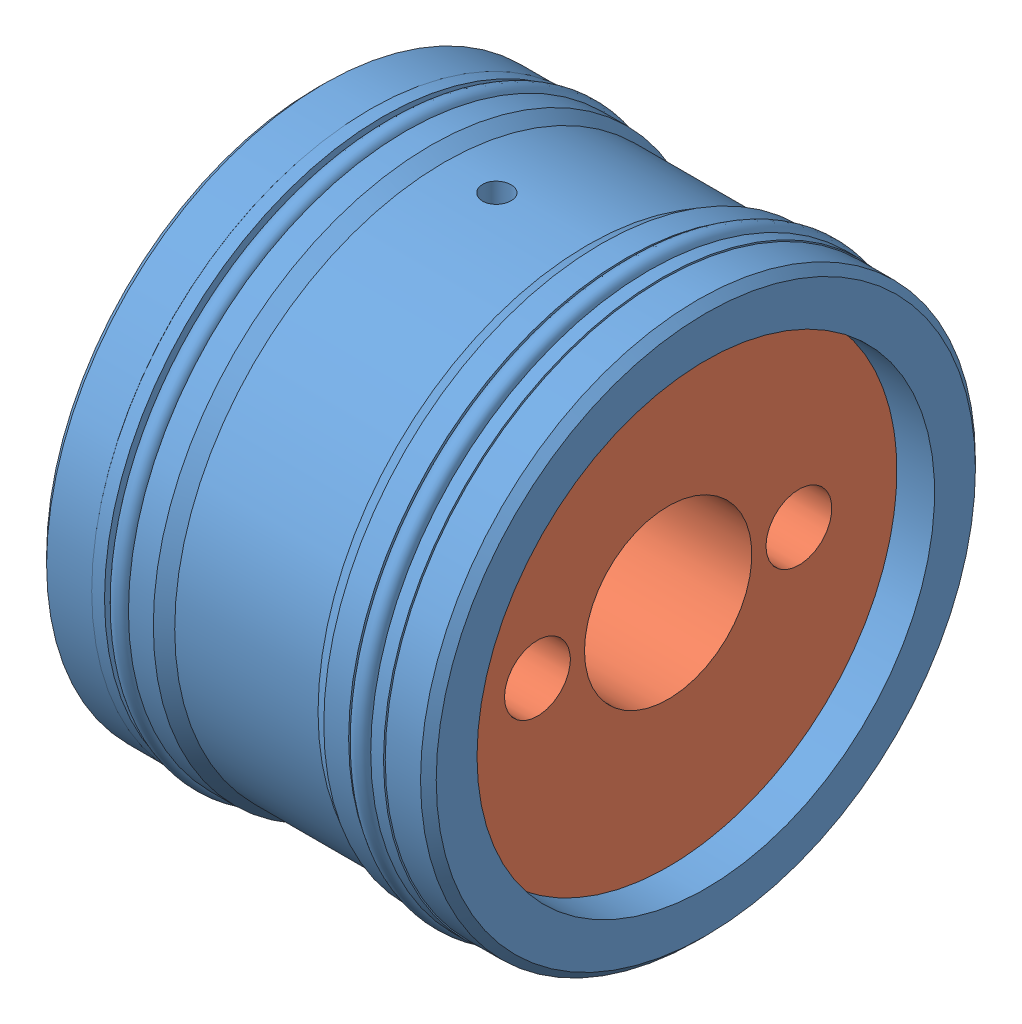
SolidWorks assembly ILC21411600.sldasm, configuration Default (file format 3400). Lengths in mm.
Overall size (44.42 54.79 54.79).
2 component instances, 2 part files, 3 mates.
Components (placement in the parent):
- ILC21411600_BODY-1: ILC21411600_BODY.sldprt [Default] at origin size (37.85 54.79 54.79)
- ILC21411600_PLUNGER-1: ILC21411600_PLUNGER.sldprt [Default] at (15.2654 0 0) x (-1 0 0) z (0 0 1) size (40.77 44.45 44.45)
Mates (geometry in assembly coordinates):
- MID STROKE: distance = 3.6576 mm aligned: plane of ILC21411600_PLUNGER-1 through (15.2654 -8.128 0) normal (1 0 0); plane of ILC21411600_BODY-1 through (18.923 26.9494 0) normal (1 0 0)
- Coincident2: coincident aligned: unknown of ILC21411600_PLUNGER-1
- Concentric2: concentric anti-aligned: cylinder of ILC21411600_BODY-1; cylinder of ILC21411600_PLUNGER-1
